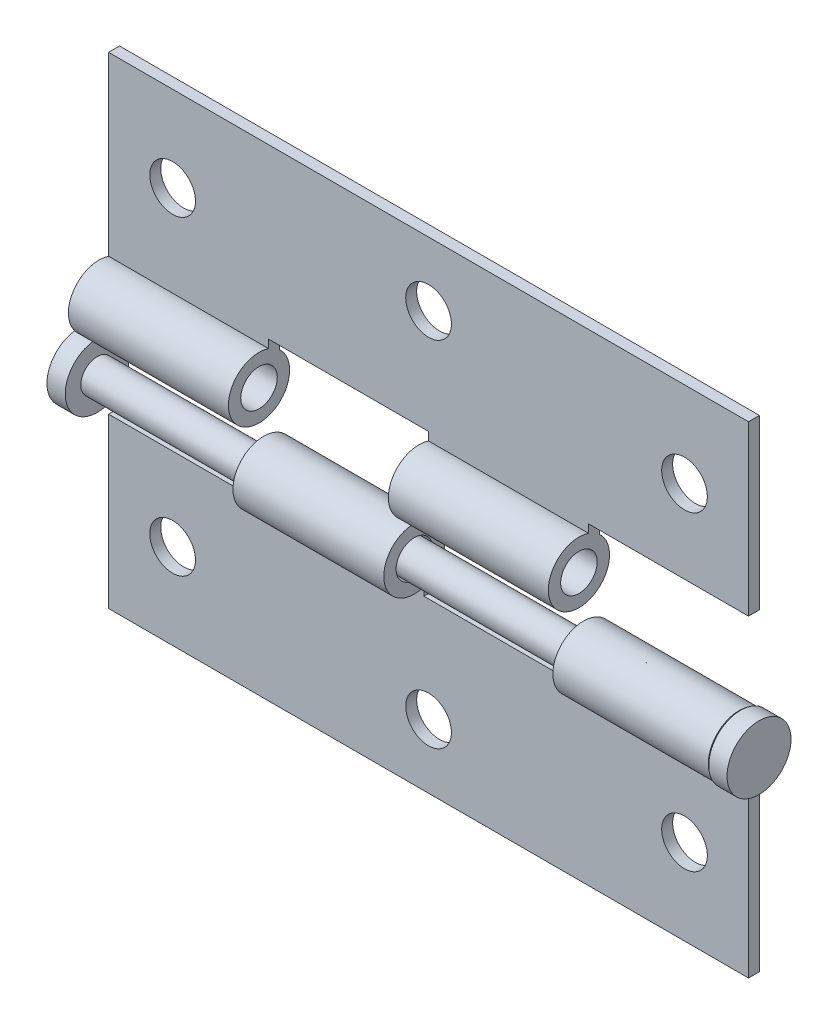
from build123d import *

# Parameters (mm, degrees)
SKETCH1_R           = 2
BOSS_EXTRUDE1_DEPTH = 35
BOSS_EXTRUDE2_START = 0.2
SKETCH2_R           = 1.8
BOSS_EXTRUDE2_DEPTH = 70.4
SKETCH3_R           = 3.5
BOSS_EXTRUDE3_DEPTH = 2
SKETCH4_W           = 18.5
SKETCH4_H           = 7.431194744
SKETCH4_W_2         = 17.5
CUT_EXTRUDE1_DEPTH  = 46.948068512
LPATTERN1_COUNT     = 2
LPATTERN1_PITCH     = 35
SKETCH5_R           = 2.5
CUT_EXTRUDE2_DEPTH  = 46.813371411


with BuildPart() as part:
    # Sketch1 → Boss-Extrude1 (new, symmetric)
    with BuildSketch(Plane(origin=(0, 0, 0), x_dir=(0, 0, -1), z_dir=(1, 0, 0))):
        with BuildLine():
            Line((-1.2, -7.031194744), (-1.2, -26.35))
            Line((-1.2, -26.35), (0, -26.35))
            Line((0, -26.35), (0, -6.331934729))
            ThreePointArc((0, -6.331934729), (-3.936636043, -0.955564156), (-1.2, -7.031194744))
        make_face()
        with Locations((-2.25, -3.85)):
            Circle(SKETCH1_R, mode=Mode.SUBTRACT)
    extrude(amount=BOSS_EXTRUDE1_DEPTH, both=True)


with BuildPart() as body_2:
    # Sketch2 → Boss-Extrude2 (new body)
    with BuildSketch(Plane(origin=(35, 0, 0), x_dir=(0, 0, -1), z_dir=(1, 0, 0)).offset(BOSS_EXTRUDE2_START)):
        with Locations((-2.25, -3.85)):
            Circle(SKETCH2_R)
    extrude(amount=-BOSS_EXTRUDE2_DEPTH)

    # Sketch3 → Boss-Extrude3 (add)
    with BuildSketch(Plane(origin=(35.2, 0, 0), x_dir=(0, 0, -1), z_dir=(1, 0, 0))):
        with Locations((-2.25, -3.85)):
            Circle(SKETCH3_R)
    boss_extrude3 = extrude(amount=BOSS_EXTRUDE3_DEPTH)

    # Mirror1: Boss-Extrude3 across plane
    add(boss_extrude3.mirror(Plane(origin=(0, 0, 0), x_dir=(0, 0, 1), z_dir=(1, 0, 0))))


with BuildPart() as body_3:
    # Mirror2: mirrored copy
    add(part.part.mirror(Plane.ZX))


with BuildPart() as cut_extrude1_tool:
    # Sketch4 → Cut-Extrude1 (new, symmetric)
    with BuildSketch(Plane.XY):
        with Locations((8.75, -4.215597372)):
            Rectangle(SKETCH4_W, SKETCH4_H)
        with Locations((26.25, 4.215597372)):
            Rectangle(SKETCH4_W_2, SKETCH4_H)
    cut_extrude1 = extrude(amount=CUT_EXTRUDE1_DEPTH, both=True)


with BuildPart() as part_1:
    add(part.part)

    # Cut-Extrude1: cut by cut_extrude1_tool
    add(cut_extrude1_tool.part, mode=Mode.SUBTRACT)


with BuildPart() as body_3_1:
    add(body_3.part)

    # Cut-Extrude1: cut by cut_extrude1_tool
    add(cut_extrude1_tool.part, mode=Mode.SUBTRACT)


with BuildPart() as lpattern1_tool:
    # LPattern1: Cut-Extrude1 ×2
    with Locations(*[(-i * LPATTERN1_PITCH, 0, 0) for i in range(1, LPATTERN1_COUNT)]):
        add(cut_extrude1)


with BuildPart() as part_2:
    add(part_1.part)

    # LPattern1: cut by lpattern1_tool
    add(lpattern1_tool.part, mode=Mode.SUBTRACT)


with BuildPart() as body_3_2:
    add(body_3_1.part)

    # LPattern1: cut by lpattern1_tool
    add(lpattern1_tool.part, mode=Mode.SUBTRACT)


with BuildPart() as cut_extrude2_tool:
    # Sketch5 → Cut-Extrude2 (new, through all)
    with BuildSketch(Plane.XY.offset(1.2)):
        with Locations((-28, -17)):
            Circle(SKETCH5_R)
        with Locations((28, -17)):
            Circle(SKETCH5_R)
        with Locations((0, -19.35)):
            Circle(SKETCH5_R)
        with Locations((0, 19.35)):
            Circle(SKETCH5_R)
        with Locations((28, 17)):
            Circle(SKETCH5_R)
        with Locations((-28, 17)):
            Circle(SKETCH5_R)
    extrude(amount=-CUT_EXTRUDE2_DEPTH)


with BuildPart() as part_3:
    add(part_2.part)

    # Cut-Extrude2: cut by cut_extrude2_tool
    add(cut_extrude2_tool.part, mode=Mode.SUBTRACT)


with BuildPart() as body_3_3:
    add(body_3_2.part)

    # Cut-Extrude2: cut by cut_extrude2_tool
    add(cut_extrude2_tool.part, mode=Mode.SUBTRACT)


solid = Compound([body_2.part, part_3.part, body_3_3.part])
